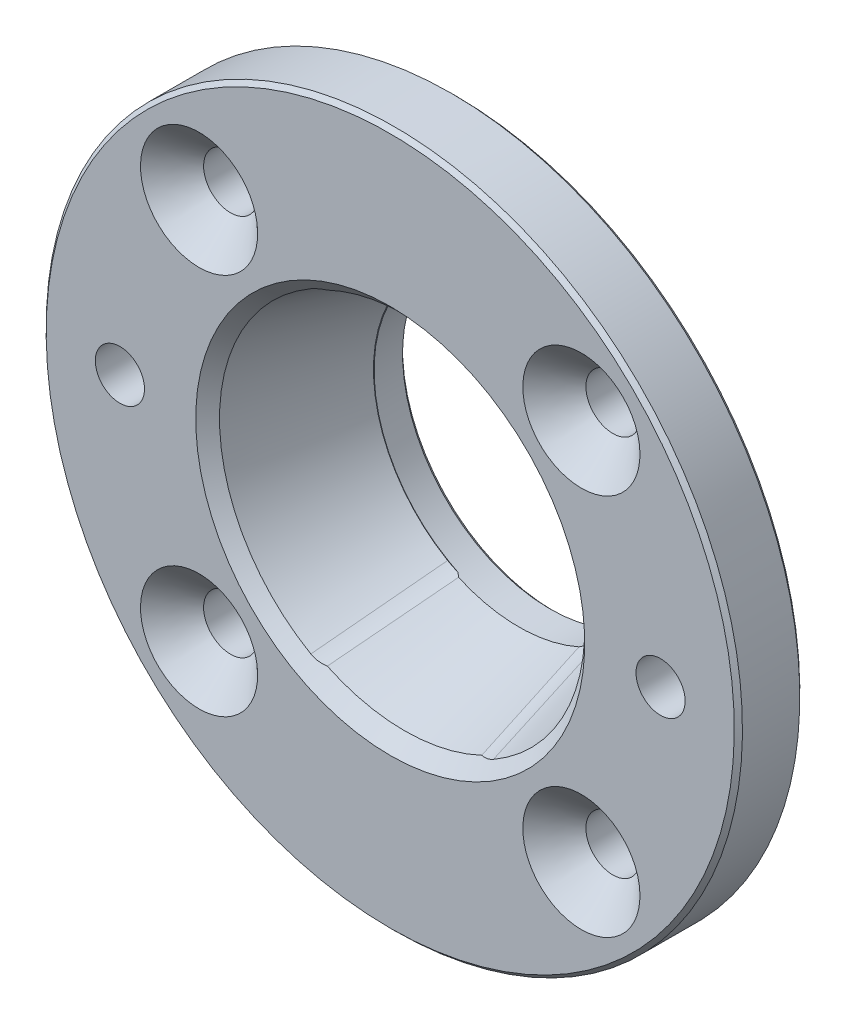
ISO-10303-21;
HEADER;
FILE_DESCRIPTION(('STEP AP214'),'2;1');
FILE_NAME('part.step','',(''),(''),'','','');
FILE_SCHEMA(('AUTOMOTIVE_DESIGN { 1 0 10303 214 1 1 1 1 }'));
ENDSEC;
DATA;
#1=APPLICATION_CONTEXT('core data for automotive mechanical design processes');
#2=APPLICATION_PROTOCOL_DEFINITION('international standard','automotive_design',2000,#1);
#3=PRODUCT_CONTEXT('',#1,'mechanical');
#4=PRODUCT('Part','Part','',(#3));
#5=PRODUCT_RELATED_PRODUCT_CATEGORY('part','',(#4));
#6=PRODUCT_DEFINITION_FORMATION('','',#4);
#7=PRODUCT_DEFINITION_CONTEXT('part definition',#1,'design');
#8=PRODUCT_DEFINITION('design','',#6,#7);
#9=PRODUCT_DEFINITION_SHAPE('','',#8);
#10=(LENGTH_UNIT() NAMED_UNIT(*) SI_UNIT(.MILLI.,.METRE.));
#11=(NAMED_UNIT(*) PLANE_ANGLE_UNIT() SI_UNIT($,.RADIAN.));
#12=(NAMED_UNIT(*) SI_UNIT($,.STERADIAN.) SOLID_ANGLE_UNIT());
#13=UNCERTAINTY_MEASURE_WITH_UNIT(LENGTH_MEASURE(1.E-05),#10,'distance_accuracy_value','');
#14=(GEOMETRIC_REPRESENTATION_CONTEXT(3) GLOBAL_UNCERTAINTY_ASSIGNED_CONTEXT((#13)) GLOBAL_UNIT_ASSIGNED_CONTEXT((#10,
#11,#12)) REPRESENTATION_CONTEXT('',''));
#15=CARTESIAN_POINT('',(0.,0.,0.));
#16=DIRECTION('',(0.,0.,1.));
#17=DIRECTION('',(1.,0.,0.));
#18=AXIS2_PLACEMENT_3D('',#15,#16,#17);
#19=CARTESIAN_POINT('',(0.,0.,-15.693364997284));
#20=DIRECTION('',(0.,0.,1.));
#21=DIRECTION('',(0.,-1.,0.));
#22=AXIS2_PLACEMENT_3D('',#19,#20,#21);
#23=CONICAL_SURFACE('',#22,18.,0.279252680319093);
#24=CARTESIAN_POINT('',(0.,0.,-1.74370722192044));
#25=DIRECTION('',(0.,0.,-1.));
#26=DIRECTION('',(0.,1.,0.));
#27=AXIS2_PLACEMENT_3D('',#24,#25,#26);
#28=CIRCLE('',#27,22.);
#29=CARTESIAN_POINT('',(-9.42545497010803,19.8786518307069,-1.74370722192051));
#30=VERTEX_POINT('',#29);
#31=CARTESIAN_POINT('',(9.42545497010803,19.8786518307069,-1.74370722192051));
#32=VERTEX_POINT('',#31);
#33=EDGE_CURVE('E107',#30,#32,#28,.T.);
#34=ORIENTED_EDGE('',*,*,#33,.F.);
#35=CARTESIAN_POINT('',(-7.35302421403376,16.4295760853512,-15.6935649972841));
#36=CARTESIAN_POINT('',(-7.64139008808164,16.90410505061,-13.7721903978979));
#37=CARTESIAN_POINT('',(-7.92830075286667,17.3789305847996,-11.8506715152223));
#38=CARTESIAN_POINT('',(-8.49987107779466,18.3290503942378,-8.00741608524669));
#39=CARTESIAN_POINT('',(-8.78453073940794,18.8043446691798,-6.08567953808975));
#40=CARTESIAN_POINT('',(-9.1709020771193,19.4515091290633,-3.46987543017));
#41=CARTESIAN_POINT('',(-9.2733056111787,19.6232293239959,-2.77587277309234));
#42=CARTESIAN_POINT('',(-9.47792179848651,19.9667113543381,-1.38784944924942));
#43=CARTESIAN_POINT('',(-9.58013445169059,20.1384731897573,-0.693828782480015));
#44=CARTESIAN_POINT('',(-9.6822599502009,20.3102541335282,0.000199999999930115));
#45=B_SPLINE_CURVE_WITH_KNOTS('',3,(#35,#36,#37,#38,#39,#40,#41,#42,#43,#44),.UNSPECIFIED.,.F.,
.F.,(4,2,2,2,4),(0.,6.00000800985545,12.0000121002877,14.1666975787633,16.3333835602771),.UNSPECIFIED.);
#46=CARTESIAN_POINT('',(-7.35305423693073,16.4296254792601,-15.6933649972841));
#47=VERTEX_POINT('',#46);
#48=EDGE_CURVE('E248',#47,#30,#45,.T.);
#49=ORIENTED_EDGE('',*,*,#48,.F.);
#50=CARTESIAN_POINT('',(0.,0.,-15.693364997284));
#51=DIRECTION('',(0.,0.,1.));
#52=DIRECTION('',(0.,-1.,0.));
#53=AXIS2_PLACEMENT_3D('',#50,#51,#52);
#54=CIRCLE('',#53,18.);
#55=CARTESIAN_POINT('',(7.35305423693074,16.4296254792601,-15.6933649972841));
#56=VERTEX_POINT('',#55);
#57=EDGE_CURVE('E127',#56,#47,#54,.T.);
#58=ORIENTED_EDGE('',*,*,#57,.F.);
#59=CARTESIAN_POINT('',(9.68225995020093,20.3102541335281,0.000199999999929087));
#60=CARTESIAN_POINT('',(9.42060674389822,19.8701956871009,-1.77774052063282));
#61=CARTESIAN_POINT('',(9.15844250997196,19.4302521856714,-3.55563479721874));
#62=CARTESIAN_POINT('',(8.63262309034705,18.5506848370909,-7.11128040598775));
#63=CARTESIAN_POINT('',(8.36896790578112,18.1110609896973,-8.8890317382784));
#64=CARTESIAN_POINT('',(7.97960231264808,17.4645303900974,-11.5045484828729));
#65=CARTESIAN_POINT('',(7.85465429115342,17.2574646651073,-12.3423880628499));
#66=CARTESIAN_POINT('',(7.60424430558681,16.8434381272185,-14.0180166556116));
#67=CARTESIAN_POINT('',(7.47878234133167,16.6364773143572,-14.8558056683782));
#68=CARTESIAN_POINT('',(7.35302421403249,16.429576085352,-15.6935649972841));
#69=B_SPLINE_CURVE_WITH_KNOTS('',3,(#59,#60,#61,#62,#63,#64,#65,#66,#67,#68),.UNSPECIFIED.,.F.,
.F.,(4,2,2,2,4),(0.,5.55055717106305,11.1011101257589,13.717246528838,16.3333838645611),.UNSPECIFIED.);
#70=EDGE_CURVE('E120',#32,#56,#69,.T.);
#71=ORIENTED_EDGE('',*,*,#70,.F.);
#72=EDGE_LOOP('',(#34,#49,#58,#71));
#73=FACE_BOUND('',#72,.T.);
#74=ADVANCED_FACE('F16',(#73),#23,.F.);
#75=CARTESIAN_POINT('',(0.,0.,0.));
#76=DIRECTION('',(0.,0.,1.));
#77=DIRECTION('',(0.,-1.,0.));
#78=AXIS2_PLACEMENT_3D('',#75,#76,#77);
#79=CYLINDRICAL_SURFACE('',#78,18.);
#80=CARTESIAN_POINT('',(0.,0.,-10.8687068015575));
#81=DIRECTION('',(0.1378186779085,0.238708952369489,-0.96126169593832));
#82=DIRECTION('',(0.480630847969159,0.832477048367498,0.275637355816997));
#83=AXIS2_PLACEMENT_3D('',#80,#81,#82);
#84=ELLIPSE('',#83,18.7253898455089,18.);
#85=CARTESIAN_POINT('',(-7.77013182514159,-16.2365344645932,-16.0147304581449));
#86=VERTEX_POINT('',#85);
#87=CARTESIAN_POINT('',(-9.,-15.5884572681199,-16.030123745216));
#88=VERTEX_POINT('',#87);
#89=EDGE_CURVE('E326',#86,#88,#84,.T.);
#90=ORIENTED_EDGE('',*,*,#89,.F.);
#91=CARTESIAN_POINT('',(-7.35305423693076,-16.4296254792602,-15.693364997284));
#92=CARTESIAN_POINT('',(-7.38625739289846,-16.4147653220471,-15.7228188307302));
#93=CARTESIAN_POINT('',(-7.41985621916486,-16.399607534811,-15.7516816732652));
#94=CARTESIAN_POINT('',(-7.48779826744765,-16.3686978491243,-15.8080782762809));
#95=CARTESIAN_POINT('',(-7.52214041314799,-16.352946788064,-15.8356137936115));
#96=CARTESIAN_POINT('',(-7.5916139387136,-16.3208107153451,-15.8892904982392));
#97=CARTESIAN_POINT('',(-7.62674534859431,-16.3044256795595,-15.9154316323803));
#98=CARTESIAN_POINT('',(-7.69783319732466,-16.2709836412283,-15.966233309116));
#99=CARTESIAN_POINT('',(-7.73379069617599,-16.2539257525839,-15.9908917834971));
#100=CARTESIAN_POINT('',(-7.77013182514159,-16.2365344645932,-16.0147304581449));
#101=B_SPLINE_CURVE_WITH_KNOTS('',3,(#91,#92,#93,#94,#95,#96,#97,#98,#99,#100),.UNSPECIFIED.,
.F.,.F.,(4,2,2,2,4),(0.,0.140416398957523,0.280641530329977,0.420872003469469,
0.561293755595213),.UNSPECIFIED.);
#102=CARTESIAN_POINT('',(-7.35305423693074,-16.4296254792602,-15.693364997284));
#103=VERTEX_POINT('',#102);
#104=EDGE_CURVE('E396',#103,#86,#101,.T.);
#105=ORIENTED_EDGE('',*,*,#104,.F.);
#106=CARTESIAN_POINT('',(7.35305423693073,-16.4296254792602,-15.693364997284));
#107=VERTEX_POINT('',#106);
#108=EDGE_CURVE('E331',#103,#107,#54,.T.);
#109=ORIENTED_EDGE('',*,*,#108,.T.);
#110=CARTESIAN_POINT('',(7.77013182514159,-16.2365344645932,-16.0147304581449));
#111=CARTESIAN_POINT('',(7.733790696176,-16.2539257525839,-15.9908917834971));
#112=CARTESIAN_POINT('',(7.69783319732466,-16.2709836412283,-15.966233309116));
#113=CARTESIAN_POINT('',(7.62674534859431,-16.3044256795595,-15.9154316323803));
#114=CARTESIAN_POINT('',(7.59161393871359,-16.3208107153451,-15.8892904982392));
#115=CARTESIAN_POINT('',(7.52214041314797,-16.3529467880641,-15.8356137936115));
#116=CARTESIAN_POINT('',(7.48779826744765,-16.3686978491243,-15.8080782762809));
#117=CARTESIAN_POINT('',(7.41985621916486,-16.399607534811,-15.7516816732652));
#118=CARTESIAN_POINT('',(7.38625739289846,-16.4147653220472,-15.7228188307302));
#119=CARTESIAN_POINT('',(7.35305423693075,-16.4296254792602,-15.693364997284));
#120=B_SPLINE_CURVE_WITH_KNOTS('',3,(#110,#111,#112,#113,#114,#115,#116,#117,#118,#119),
.UNSPECIFIED.,.F.,.F.,(4,2,2,2,4),(0.,0.140421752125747,0.280652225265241,0.420877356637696,
0.56129375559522),.UNSPECIFIED.);
#121=CARTESIAN_POINT('',(7.77013182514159,-16.2365344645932,-16.0147304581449));
#122=VERTEX_POINT('',#121);
#123=EDGE_CURVE('E221',#122,#107,#120,.T.);
#124=ORIENTED_EDGE('',*,*,#123,.F.);
#125=CARTESIAN_POINT('',(0.,0.,-10.8687068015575));
#126=DIRECTION('',(-0.1378186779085,0.238708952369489,-0.96126169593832));
#127=DIRECTION('',(-0.480630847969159,0.832477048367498,0.275637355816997));
#128=AXIS2_PLACEMENT_3D('',#125,#126,#127);
#129=ELLIPSE('',#128,18.7253898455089,18.);
#130=CARTESIAN_POINT('',(9.,-15.5884572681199,-16.030123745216));
#131=VERTEX_POINT('',#130);
#132=EDGE_CURVE('E133',#131,#122,#129,.T.);
#133=ORIENTED_EDGE('',*,*,#132,.F.);
#134=CARTESIAN_POINT('',(0.,0.,-16.030123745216));
#135=DIRECTION('',(0.,0.,-1.));
#136=DIRECTION('',(0.,1.,0.));
#137=AXIS2_PLACEMENT_3D('',#134,#135,#136);
#138=CIRCLE('',#137,18.);
#139=CARTESIAN_POINT('',(9.,15.5884572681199,-16.0301237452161));
#140=VERTEX_POINT('',#139);
#141=EDGE_CURVE('E361',#131,#140,#138,.F.);
#142=ORIENTED_EDGE('',*,*,#141,.T.);
#143=CARTESIAN_POINT('',(0.,0.,-10.8687068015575));
#144=DIRECTION('',(-0.1378186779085,-0.238708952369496,-0.961261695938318));
#145=DIRECTION('',(-0.480630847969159,-0.832477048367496,0.275637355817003));
#146=AXIS2_PLACEMENT_3D('',#143,#144,#145);
#147=ELLIPSE('',#146,18.7253898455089,18.);
#148=CARTESIAN_POINT('',(7.77013182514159,16.2365344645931,-16.014730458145));
#149=VERTEX_POINT('',#148);
#150=EDGE_CURVE('E131',#149,#140,#147,.T.);
#151=ORIENTED_EDGE('',*,*,#150,.F.);
#152=CARTESIAN_POINT('',(7.35305423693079,16.4296254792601,-15.6933649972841));
#153=CARTESIAN_POINT('',(7.38625739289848,16.414765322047,-15.7228188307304));
#154=CARTESIAN_POINT('',(7.41985621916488,16.3996075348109,-15.7516816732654));
#155=CARTESIAN_POINT('',(7.48779826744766,16.3686978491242,-15.808078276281));
#156=CARTESIAN_POINT('',(7.52214041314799,16.3529467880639,-15.8356137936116));
#157=CARTESIAN_POINT('',(7.5916139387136,16.320810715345,-15.8892904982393));
#158=CARTESIAN_POINT('',(7.62674534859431,16.3044256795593,-15.9154316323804));
#159=CARTESIAN_POINT('',(7.69783319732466,16.2709836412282,-15.9662333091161));
#160=CARTESIAN_POINT('',(7.73379069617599,16.2539257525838,-15.9908917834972));
#161=CARTESIAN_POINT('',(7.77013182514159,16.2365344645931,-16.014730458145));
#162=B_SPLINE_CURVE_WITH_KNOTS('',3,(#152,#153,#154,#155,#156,#157,#158,#159,#160,#161),
.UNSPECIFIED.,.F.,.F.,(4,2,2,2,4),(0.,0.140416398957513,0.28064153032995,0.420872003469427,
0.561293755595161),.UNSPECIFIED.);
#163=EDGE_CURVE('E128',#56,#149,#162,.T.);
#164=ORIENTED_EDGE('',*,*,#163,.F.);
#165=ORIENTED_EDGE('',*,*,#57,.T.);
#166=CARTESIAN_POINT('',(-7.77013182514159,16.2365344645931,-16.014730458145));
#167=CARTESIAN_POINT('',(-7.73379069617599,16.2539257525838,-15.9908917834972));
#168=CARTESIAN_POINT('',(-7.69783319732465,16.2709836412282,-15.9662333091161));
#169=CARTESIAN_POINT('',(-7.6267453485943,16.3044256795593,-15.9154316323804));
#170=CARTESIAN_POINT('',(-7.59161393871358,16.320810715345,-15.8892904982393));
#171=CARTESIAN_POINT('',(-7.52214041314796,16.3529467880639,-15.8356137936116));
#172=CARTESIAN_POINT('',(-7.48779826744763,16.3686978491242,-15.808078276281));
#173=CARTESIAN_POINT('',(-7.41985621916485,16.3996075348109,-15.7516816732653));
#174=CARTESIAN_POINT('',(-7.38625739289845,16.414765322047,-15.7228188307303));
#175=CARTESIAN_POINT('',(-7.35305423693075,16.4296254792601,-15.6933649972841));
#176=B_SPLINE_CURVE_WITH_KNOTS('',3,(#166,#167,#168,#169,#170,#171,#172,#173,#174,#175),
.UNSPECIFIED.,.F.,.F.,(4,2,2,2,4),(0.,0.14042175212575,0.280652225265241,0.420877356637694,
0.561293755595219),.UNSPECIFIED.);
#177=CARTESIAN_POINT('',(-7.77013182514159,16.2365344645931,-16.014730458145));
#178=VERTEX_POINT('',#177);
#179=EDGE_CURVE('E240',#178,#47,#176,.T.);
#180=ORIENTED_EDGE('',*,*,#179,.F.);
#181=CARTESIAN_POINT('',(0.,0.,-10.8687068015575));
#182=DIRECTION('',(0.1378186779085,-0.238708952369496,-0.961261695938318));
#183=DIRECTION('',(0.480630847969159,-0.832477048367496,0.275637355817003));
#184=AXIS2_PLACEMENT_3D('',#181,#182,#183);
#185=ELLIPSE('',#184,18.7253898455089,18.);
#186=CARTESIAN_POINT('',(-9.,15.5884572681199,-16.0301237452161));
#187=VERTEX_POINT('',#186);
#188=EDGE_CURVE('E247',#187,#178,#185,.T.);
#189=ORIENTED_EDGE('',*,*,#188,.F.);
#190=CARTESIAN_POINT('',(0.,0.,-16.030123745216));
#191=DIRECTION('',(0.,0.,-1.));
#192=DIRECTION('',(0.,1.,0.));
#193=AXIS2_PLACEMENT_3D('',#190,#191,#192);
#194=CIRCLE('',#193,18.);
#195=EDGE_CURVE('E363',#187,#88,#194,.F.);
#196=ORIENTED_EDGE('',*,*,#195,.T.);
#197=EDGE_LOOP('',(#90,#105,#109,#124,#133,#142,#151,#164,#165,#180,#189,#196));
#198=FACE_BOUND('',#197,.T.);
#199=CARTESIAN_POINT('',(0.,0.,-19.5));
#200=DIRECTION('',(0.,0.,-1.));
#201=DIRECTION('',(0.,1.,0.));
#202=AXIS2_PLACEMENT_3D('',#199,#200,#201);
#203=CIRCLE('',#202,18.);
#204=CARTESIAN_POINT('',(0.,17.9999999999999,-19.5000000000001));
#205=VERTEX_POINT('',#204);
#206=EDGE_CURVE('E352',#205,#205,#203,.T.);
#207=ORIENTED_EDGE('',*,*,#206,.T.);
#208=EDGE_LOOP('',(#207));
#209=FACE_BOUND('',#208,.T.);
#210=ADVANCED_FACE('F227',(#198,#209),#79,.F.);
#211=CARTESIAN_POINT('',(22.5,0.,0.));
#212=DIRECTION('',(0.,0.,1.));
#213=DIRECTION('',(0.,-1.,0.));
#214=AXIS2_PLACEMENT_3D('',#211,#212,#213);
#215=PLANE('',#214);
#216=CARTESIAN_POINT('',(-33.,0.,0.));
#217=DIRECTION('',(0.,0.,1.));
#218=DIRECTION('',(1.,0.,0.));
#219=AXIS2_PLACEMENT_3D('',#216,#217,#218);
#220=CIRCLE('',#219,3.);
#221=CARTESIAN_POINT('',(-30.,0.,0.));
#222=VERTEX_POINT('',#221);
#223=EDGE_CURVE('E378',#222,#222,#220,.T.);
#224=ORIENTED_EDGE('',*,*,#223,.F.);
#225=EDGE_LOOP('',(#224));
#226=FACE_BOUND('',#225,.T.);
#227=CARTESIAN_POINT('',(33.,0.,0.));
#228=DIRECTION('',(0.,0.,1.));
#229=DIRECTION('',(1.,0.,0.));
#230=AXIS2_PLACEMENT_3D('',#227,#228,#229);
#231=CIRCLE('',#230,3.);
#232=CARTESIAN_POINT('',(36.,0.,0.));
#233=VERTEX_POINT('',#232);
#234=EDGE_CURVE('E383',#233,#233,#231,.T.);
#235=ORIENTED_EDGE('',*,*,#234,.F.);
#236=EDGE_LOOP('',(#235));
#237=FACE_BOUND('',#236,.T.);
#238=CARTESIAN_POINT('',(0.,0.,0.));
#239=DIRECTION('',(0.,0.,-1.));
#240=DIRECTION('',(0.,1.,0.));
#241=AXIS2_PLACEMENT_3D('',#238,#239,#240);
#242=CIRCLE('',#241,23.7437072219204);
#243=CARTESIAN_POINT('',(0.,23.7437072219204,0.));
#244=VERTEX_POINT('',#243);
#245=EDGE_CURVE('E296',#244,#244,#242,.T.);
#246=ORIENTED_EDGE('',*,*,#245,.T.);
#247=EDGE_LOOP('',(#246));
#248=FACE_BOUND('',#247,.T.);
#249=CARTESIAN_POINT('',(0.,0.,0.));
#250=DIRECTION('',(0.,0.,1.));
#251=DIRECTION('',(0.,-1.,0.));
#252=AXIS2_PLACEMENT_3D('',#249,#250,#251);
#253=CIRCLE('',#252,42.);
#254=CARTESIAN_POINT('',(0.,-42.,1.46642216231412E-13));
#255=VERTEX_POINT('',#254);
#256=EDGE_CURVE('E355',#255,#255,#253,.T.);
#257=ORIENTED_EDGE('',*,*,#256,.T.);
#258=EDGE_LOOP('',(#257));
#259=FACE_BOUND('',#258,.T.);
#260=CARTESIAN_POINT('',(23.334523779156,23.3345237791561,0.));
#261=DIRECTION('',(0.,0.,1.));
#262=DIRECTION('',(0.,-1.,0.));
#263=AXIS2_PLACEMENT_3D('',#260,#261,#262);
#264=CIRCLE('',#263,7.15);
#265=CARTESIAN_POINT('',(23.334523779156,16.1845237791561,0.));
#266=VERTEX_POINT('',#265);
#267=EDGE_CURVE('E420',#266,#266,#264,.T.);
#268=ORIENTED_EDGE('',*,*,#267,.F.);
#269=EDGE_LOOP('',(#268));
#270=FACE_BOUND('',#269,.T.);
#271=CARTESIAN_POINT('',(23.3345237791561,-23.334523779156,0.));
#272=DIRECTION('',(0.,0.,1.));
#273=DIRECTION('',(0.,-1.,0.));
#274=AXIS2_PLACEMENT_3D('',#271,#272,#273);
#275=CIRCLE('',#274,7.15);
#276=CARTESIAN_POINT('',(23.3345237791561,-30.484523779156,1.06436145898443E-13));
#277=VERTEX_POINT('',#276);
#278=EDGE_CURVE('E430',#277,#277,#275,.T.);
#279=ORIENTED_EDGE('',*,*,#278,.F.);
#280=EDGE_LOOP('',(#279));
#281=FACE_BOUND('',#280,.T.);
#282=CARTESIAN_POINT('',(-23.334523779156,-23.3345237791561,0.));
#283=DIRECTION('',(0.,0.,1.));
#284=DIRECTION('',(0.,-1.,0.));
#285=AXIS2_PLACEMENT_3D('',#282,#283,#284);
#286=CIRCLE('',#285,7.15);
#287=CARTESIAN_POINT('',(-23.334523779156,-30.4845237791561,1.06436145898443E-13));
#288=VERTEX_POINT('',#287);
#289=EDGE_CURVE('E436',#288,#288,#286,.T.);
#290=ORIENTED_EDGE('',*,*,#289,.F.);
#291=EDGE_LOOP('',(#290));
#292=FACE_BOUND('',#291,.T.);
#293=CARTESIAN_POINT('',(-23.3345237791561,23.334523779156,0.));
#294=DIRECTION('',(0.,0.,1.));
#295=DIRECTION('',(0.,-1.,0.));
#296=AXIS2_PLACEMENT_3D('',#293,#294,#295);
#297=CIRCLE('',#296,7.15);
#298=CARTESIAN_POINT('',(-23.3345237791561,16.184523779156,0.));
#299=VERTEX_POINT('',#298);
#300=EDGE_CURVE('E442',#299,#299,#297,.T.);
#301=ORIENTED_EDGE('',*,*,#300,.F.);
#302=EDGE_LOOP('',(#301));
#303=FACE_BOUND('',#302,.T.);
#304=ADVANCED_FACE('F231',(#226,#237,#248,#259,#270,#281,#292,#303),#215,.T.);
#305=CARTESIAN_POINT('',(9.42545497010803,-19.8786518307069,-1.74370722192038));
#306=VERTEX_POINT('',#305);
#307=CARTESIAN_POINT('',(-9.42545497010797,-19.8786518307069,-1.74370722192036));
#308=VERTEX_POINT('',#307);
#309=EDGE_CURVE('E33',#306,#308,#28,.T.);
#310=ORIENTED_EDGE('',*,*,#309,.F.);
#311=CARTESIAN_POINT('',(7.35302421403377,-16.4295760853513,-15.693564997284));
#312=CARTESIAN_POINT('',(7.64139008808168,-16.9041050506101,-13.7721903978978));
#313=CARTESIAN_POINT('',(7.92830075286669,-17.3789305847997,-11.8506715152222));
#314=CARTESIAN_POINT('',(8.49987107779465,-18.3290503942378,-8.00741608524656));
#315=CARTESIAN_POINT('',(8.78453073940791,-18.8043446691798,-6.0856795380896));
#316=CARTESIAN_POINT('',(9.1709020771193,-19.4515091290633,-3.46987543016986));
#317=CARTESIAN_POINT('',(9.27330561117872,-19.6232293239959,-2.7758727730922));
#318=CARTESIAN_POINT('',(9.47792179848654,-19.9667113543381,-1.38784944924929));
#319=CARTESIAN_POINT('',(9.58013445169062,-20.1384731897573,-0.693828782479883));
#320=CARTESIAN_POINT('',(9.6822599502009,-20.3102541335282,0.000200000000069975));
#321=B_SPLINE_CURVE_WITH_KNOTS('',3,(#311,#312,#313,#314,#315,#316,#317,#318,#319,#320),
.UNSPECIFIED.,.F.,.F.,(4,2,2,2,4),(0.,6.00000800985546,12.0000121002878,14.1666975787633,
16.3333835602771),.UNSPECIFIED.);
#322=EDGE_CURVE('E214',#107,#306,#321,.T.);
#323=ORIENTED_EDGE('',*,*,#322,.F.);
#324=ORIENTED_EDGE('',*,*,#108,.F.);
#325=CARTESIAN_POINT('',(-9.68225995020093,-20.3102541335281,0.000200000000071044));
#326=CARTESIAN_POINT('',(-9.39940984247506,-19.8345642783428,-1.9217054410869));
#327=CARTESIAN_POINT('',(-9.11597624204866,-19.3590064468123,-3.84355845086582));
#328=CARTESIAN_POINT('',(-8.54732365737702,-18.4082725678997,-7.687092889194));
#329=CARTESIAN_POINT('',(-8.26210467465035,-17.9330965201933,-9.6087743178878));
#330=CARTESIAN_POINT('',(-7.87225265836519,-17.2866667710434,-12.2242433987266));
#331=CARTESIAN_POINT('',(-7.76866499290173,-17.1151962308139,-12.9181332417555));
#332=CARTESIAN_POINT('',(-7.56112793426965,-16.7723287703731,-14.3058772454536));
#333=CARTESIAN_POINT('',(-7.45717854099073,-16.6009318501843,-14.999731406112));
#334=CARTESIAN_POINT('',(-7.35302421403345,-16.4295760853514,-15.693564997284));
#335=B_SPLINE_CURVE_WITH_KNOTS('',3,(#325,#326,#327,#328,#329,#330,#331,#332,#333,#334),
.UNSPECIFIED.,.F.,.F.,(4,2,2,2,4),(0.,6.00000526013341,12.0000054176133,14.1666942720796,
16.3333837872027),.UNSPECIFIED.);
#336=EDGE_CURVE('E295',#308,#103,#335,.T.);
#337=ORIENTED_EDGE('',*,*,#336,.F.);
#338=EDGE_LOOP('',(#310,#323,#324,#337));
#339=FACE_BOUND('',#338,.T.);
#340=ADVANCED_FACE('F148',(#339),#23,.F.);
#341=CARTESIAN_POINT('',(18.,0.,-20.));
#342=DIRECTION('',(0.,0.,-1.));
#343=DIRECTION('',(0.,1.,0.));
#344=AXIS2_PLACEMENT_3D('',#341,#342,#343);
#345=PLANE('',#344);
#346=CARTESIAN_POINT('',(0.,0.,-20.));
#347=DIRECTION('',(0.,0.,-1.));
#348=DIRECTION('',(0.,1.,0.));
#349=AXIS2_PLACEMENT_3D('',#346,#347,#348);
#350=CIRCLE('',#349,18.5);
#351=CARTESIAN_POINT('',(0.,18.4999999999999,-20.0000000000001));
#352=VERTEX_POINT('',#351);
#353=EDGE_CURVE('E349',#352,#352,#350,.F.);
#354=ORIENTED_EDGE('',*,*,#353,.T.);
#355=EDGE_LOOP('',(#354));
#356=FACE_BOUND('',#355,.T.);
#357=CARTESIAN_POINT('',(0.,0.,-20.));
#358=DIRECTION('',(0.,0.,-1.));
#359=DIRECTION('',(0.,1.,0.));
#360=AXIS2_PLACEMENT_3D('',#357,#358,#359);
#361=CIRCLE('',#360,24.4);
#362=CARTESIAN_POINT('',(0.,24.3999999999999,-20.0000000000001));
#363=VERTEX_POINT('',#362);
#364=EDGE_CURVE('E345',#363,#363,#361,.T.);
#365=ORIENTED_EDGE('',*,*,#364,.T.);
#366=EDGE_LOOP('',(#365));
#367=FACE_BOUND('',#366,.T.);
#368=ADVANCED_FACE('F233',(#356,#367),#345,.T.);
#369=CARTESIAN_POINT('',(0.,0.,0.));
#370=DIRECTION('',(0.,0.,1.));
#371=DIRECTION('',(0.,-1.,0.));
#372=AXIS2_PLACEMENT_3D('',#369,#370,#371);
#373=CYLINDRICAL_SURFACE('',#372,25.);
#374=CARTESIAN_POINT('',(0.,0.,-10.));
#375=DIRECTION('',(0.,0.,1.));
#376=DIRECTION('',(0.,-1.,0.));
#377=AXIS2_PLACEMENT_3D('',#374,#375,#376);
#378=CIRCLE('',#377,25.);
#379=CARTESIAN_POINT('',(0.,-25.,-9.99999999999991));
#380=VERTEX_POINT('',#379);
#381=EDGE_CURVE('E448',#380,#380,#378,.T.);
#382=ORIENTED_EDGE('',*,*,#381,.F.);
#383=EDGE_LOOP('',(#382));
#384=FACE_BOUND('',#383,.T.);
#385=CARTESIAN_POINT('',(0.,0.,-15.9));
#386=DIRECTION('',(0.,0.,1.));
#387=DIRECTION('',(0.,-1.,0.));
#388=AXIS2_PLACEMENT_3D('',#385,#386,#387);
#389=CIRCLE('',#388,25.);
#390=CARTESIAN_POINT('',(0.,-25.0000000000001,-15.8999999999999));
#391=VERTEX_POINT('',#390);
#392=EDGE_CURVE('E336',#391,#391,#389,.T.);
#393=ORIENTED_EDGE('',*,*,#392,.T.);
#394=EDGE_LOOP('',(#393));
#395=FACE_BOUND('',#394,.T.);
#396=ADVANCED_FACE('F287',(#384,#395),#373,.T.);
#397=CARTESIAN_POINT('',(25.,0.,-8.));
#398=DIRECTION('',(0.,0.,-1.));
#399=DIRECTION('',(0.,1.,0.));
#400=AXIS2_PLACEMENT_3D('',#397,#398,#399);
#401=PLANE('',#400);
#402=CARTESIAN_POINT('',(-33.,0.,-8.));
#403=DIRECTION('',(0.,0.,-1.));
#404=DIRECTION('',(0.,1.,0.));
#405=AXIS2_PLACEMENT_3D('',#402,#403,#404);
#406=CIRCLE('',#405,3.);
#407=CARTESIAN_POINT('',(-33.,3.,-8.00000000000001));
#408=VERTEX_POINT('',#407);
#409=EDGE_CURVE('E20',#408,#408,#406,.T.);
#410=ORIENTED_EDGE('',*,*,#409,.F.);
#411=EDGE_LOOP('',(#410));
#412=FACE_BOUND('',#411,.T.);
#413=CARTESIAN_POINT('',(33.,0.,-8.));
#414=DIRECTION('',(0.,0.,-1.));
#415=DIRECTION('',(0.,1.,0.));
#416=AXIS2_PLACEMENT_3D('',#413,#414,#415);
#417=CIRCLE('',#416,3.);
#418=CARTESIAN_POINT('',(33.,3.,-8.00000000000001));
#419=VERTEX_POINT('',#418);
#420=EDGE_CURVE('E376',#419,#419,#417,.T.);
#421=ORIENTED_EDGE('',*,*,#420,.F.);
#422=EDGE_LOOP('',(#421));
#423=FACE_BOUND('',#422,.T.);
#424=CARTESIAN_POINT('',(-23.3345237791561,23.334523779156,-8.));
#425=DIRECTION('',(0.,0.,-1.));
#426=DIRECTION('',(0.,1.,0.));
#427=AXIS2_PLACEMENT_3D('',#424,#425,#426);
#428=CIRCLE('',#427,3.3);
#429=CARTESIAN_POINT('',(-23.3345237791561,26.634523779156,-8.00000000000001));
#430=VERTEX_POINT('',#429);
#431=EDGE_CURVE('E10',#430,#430,#428,.T.);
#432=ORIENTED_EDGE('',*,*,#431,.F.);
#433=EDGE_LOOP('',(#432));
#434=FACE_BOUND('',#433,.T.);
#435=CARTESIAN_POINT('',(23.334523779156,23.334523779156,-8.));
#436=DIRECTION('',(0.,0.,-1.));
#437=DIRECTION('',(0.,1.,0.));
#438=AXIS2_PLACEMENT_3D('',#435,#436,#437);
#439=CIRCLE('',#438,3.3);
#440=CARTESIAN_POINT('',(23.334523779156,26.634523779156,-8.00000000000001));
#441=VERTEX_POINT('',#440);
#442=EDGE_CURVE('E25',#441,#441,#439,.T.);
#443=ORIENTED_EDGE('',*,*,#442,.F.);
#444=EDGE_LOOP('',(#443));
#445=FACE_BOUND('',#444,.T.);
#446=CARTESIAN_POINT('',(23.3345237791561,-23.3345237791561,-8.));
#447=DIRECTION('',(0.,0.,-1.));
#448=DIRECTION('',(0.,1.,0.));
#449=AXIS2_PLACEMENT_3D('',#446,#447,#448);
#450=CIRCLE('',#449,3.3);
#451=CARTESIAN_POINT('',(23.3345237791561,-20.0345237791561,-8.00000000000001));
#452=VERTEX_POINT('',#451);
#453=EDGE_CURVE('E367',#452,#452,#450,.T.);
#454=ORIENTED_EDGE('',*,*,#453,.F.);
#455=EDGE_LOOP('',(#454));
#456=FACE_BOUND('',#455,.T.);
#457=CARTESIAN_POINT('',(-23.334523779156,-23.3345237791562,-8.));
#458=DIRECTION('',(0.,0.,-1.));
#459=DIRECTION('',(0.,1.,0.));
#460=AXIS2_PLACEMENT_3D('',#457,#458,#459);
#461=CIRCLE('',#460,3.3);
#462=CARTESIAN_POINT('',(-23.334523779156,-20.0345237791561,-8.00000000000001));
#463=VERTEX_POINT('',#462);
#464=EDGE_CURVE('E364',#463,#463,#461,.T.);
#465=ORIENTED_EDGE('',*,*,#464,.F.);
#466=EDGE_LOOP('',(#465));
#467=FACE_BOUND('',#466,.T.);
#468=CARTESIAN_POINT('',(0.,0.,-8.));
#469=DIRECTION('',(0.,0.,1.));
#470=DIRECTION('',(0.,-1.,0.));
#471=AXIS2_PLACEMENT_3D('',#468,#469,#470);
#472=CIRCLE('',#471,26.);
#473=CARTESIAN_POINT('',(0.,-26.,-7.99999999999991));
#474=VERTEX_POINT('',#473);
#475=EDGE_CURVE('E457',#474,#474,#472,.T.);
#476=ORIENTED_EDGE('',*,*,#475,.T.);
#477=EDGE_LOOP('',(#476));
#478=FACE_BOUND('',#477,.T.);
#479=CARTESIAN_POINT('',(0.,0.,-8.));
#480=DIRECTION('',(0.,0.,-1.));
#481=DIRECTION('',(0.,1.,0.));
#482=AXIS2_PLACEMENT_3D('',#479,#480,#481);
#483=CIRCLE('',#482,42.);
#484=CARTESIAN_POINT('',(0.,42.,-8.00000000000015));
#485=VERTEX_POINT('',#484);
#486=EDGE_CURVE('E334',#485,#485,#483,.T.);
#487=ORIENTED_EDGE('',*,*,#486,.T.);
#488=EDGE_LOOP('',(#487));
#489=FACE_BOUND('',#488,.T.);
#490=ADVANCED_FACE('F486',(#412,#423,#434,#445,#456,#467,#478,#489),#401,.T.);
#491=CARTESIAN_POINT('',(0.,0.,0.));
#492=DIRECTION('',(0.,0.,1.));
#493=DIRECTION('',(0.,-1.,0.));
#494=AXIS2_PLACEMENT_3D('',#491,#492,#493);
#495=CYLINDRICAL_SURFACE('',#494,42.5);
#496=CARTESIAN_POINT('',(0.,0.,-0.5));
#497=DIRECTION('',(0.,0.,1.));
#498=DIRECTION('',(0.,-1.,0.));
#499=AXIS2_PLACEMENT_3D('',#496,#497,#498);
#500=CIRCLE('',#499,42.5);
#501=CARTESIAN_POINT('',(0.,-42.5,-0.499999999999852));
#502=VERTEX_POINT('',#501);
#503=EDGE_CURVE('E358',#502,#502,#500,.F.);
#504=ORIENTED_EDGE('',*,*,#503,.T.);
#505=EDGE_LOOP('',(#504));
#506=FACE_BOUND('',#505,.T.);
#507=CARTESIAN_POINT('',(0.,0.,-7.5));
#508=DIRECTION('',(0.,0.,-1.));
#509=DIRECTION('',(0.,1.,0.));
#510=AXIS2_PLACEMENT_3D('',#507,#508,#509);
#511=CIRCLE('',#510,42.5);
#512=CARTESIAN_POINT('',(0.,42.5,-7.50000000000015));
#513=VERTEX_POINT('',#512);
#514=EDGE_CURVE('E330',#513,#513,#511,.F.);
#515=ORIENTED_EDGE('',*,*,#514,.T.);
#516=EDGE_LOOP('',(#515));
#517=FACE_BOUND('',#516,.T.);
#518=ADVANCED_FACE('F480',(#506,#517),#495,.T.);
#519=CARTESIAN_POINT('',(0.,0.,-7.5));
#520=DIRECTION('',(0.,0.,1.));
#521=DIRECTION('',(0.,-1.,0.));
#522=AXIS2_PLACEMENT_3D('',#519,#520,#521);
#523=CONICAL_SURFACE('',#522,42.5,0.785398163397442);
#524=ORIENTED_EDGE('',*,*,#486,.F.);
#525=EDGE_LOOP('',(#524));
#526=FACE_BOUND('',#525,.T.);
#527=ORIENTED_EDGE('',*,*,#514,.F.);
#528=EDGE_LOOP('',(#527));
#529=FACE_BOUND('',#528,.T.);
#530=ADVANCED_FACE('F470',(#526,#529),#523,.T.);
#531=CARTESIAN_POINT('',(0.,0.,-16.));
#532=DIRECTION('',(0.,0.,1.));
#533=DIRECTION('',(0.,-1.,0.));
#534=AXIS2_PLACEMENT_3D('',#531,#532,#533);
#535=CONICAL_SURFACE('',#534,24.9,0.785398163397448);
#536=ORIENTED_EDGE('',*,*,#392,.F.);
#537=EDGE_LOOP('',(#536));
#538=FACE_BOUND('',#537,.T.);
#539=CARTESIAN_POINT('',(0.,0.,-16.));
#540=DIRECTION('',(0.,0.,1.));
#541=DIRECTION('',(0.,-1.,0.));
#542=AXIS2_PLACEMENT_3D('',#539,#540,#541);
#543=CIRCLE('',#542,24.9);
#544=CARTESIAN_POINT('',(0.,-24.9000000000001,-15.9999999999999));
#545=VERTEX_POINT('',#544);
#546=EDGE_CURVE('E459',#545,#545,#543,.T.);
#547=ORIENTED_EDGE('',*,*,#546,.T.);
#548=EDGE_LOOP('',(#547));
#549=FACE_BOUND('',#548,.T.);
#550=ADVANCED_FACE('F467',(#538,#549),#535,.T.);
#551=CARTESIAN_POINT('',(0.,0.,0.));
#552=DIRECTION('',(0.,0.,1.));
#553=DIRECTION('',(0.,-1.,0.));
#554=AXIS2_PLACEMENT_3D('',#551,#552,#553);
#555=CYLINDRICAL_SURFACE('',#554,24.9);
#556=CARTESIAN_POINT('',(0.,0.,-19.5));
#557=DIRECTION('',(0.,0.,-1.));
#558=DIRECTION('',(0.,1.,0.));
#559=AXIS2_PLACEMENT_3D('',#556,#557,#558);
#560=CIRCLE('',#559,24.9);
#561=CARTESIAN_POINT('',(0.,24.8999999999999,-19.5000000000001));
#562=VERTEX_POINT('',#561);
#563=EDGE_CURVE('E342',#562,#562,#560,.F.);
#564=ORIENTED_EDGE('',*,*,#563,.T.);
#565=EDGE_LOOP('',(#564));
#566=FACE_BOUND('',#565,.T.);
#567=ORIENTED_EDGE('',*,*,#546,.F.);
#568=EDGE_LOOP('',(#567));
#569=FACE_BOUND('',#568,.T.);
#570=ADVANCED_FACE('F469',(#566,#569),#555,.T.);
#571=CARTESIAN_POINT('',(0.,0.,-19.5));
#572=DIRECTION('',(0.,0.,1.));
#573=DIRECTION('',(0.,-1.,0.));
#574=AXIS2_PLACEMENT_3D('',#571,#572,#573);
#575=CONICAL_SURFACE('',#574,24.9,0.785398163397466);
#576=ORIENTED_EDGE('',*,*,#364,.F.);
#577=EDGE_LOOP('',(#576));
#578=FACE_BOUND('',#577,.T.);
#579=ORIENTED_EDGE('',*,*,#563,.F.);
#580=EDGE_LOOP('',(#579));
#581=FACE_BOUND('',#580,.T.);
#582=ADVANCED_FACE('F477',(#578,#581),#575,.T.);
#583=CARTESIAN_POINT('',(0.,0.,-7.5));
#584=DIRECTION('',(0.,0.,-1.));
#585=DIRECTION('',(0.,1.,0.));
#586=AXIS2_PLACEMENT_3D('',#583,#584,#585);
#587=CONICAL_SURFACE('',#586,25.5,0.785398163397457);
#588=ORIENTED_EDGE('',*,*,#475,.F.);
#589=EDGE_LOOP('',(#588));
#590=FACE_BOUND('',#589,.T.);
#591=CARTESIAN_POINT('',(0.,0.,-7.5));
#592=DIRECTION('',(0.,0.,1.));
#593=DIRECTION('',(0.,-1.,0.));
#594=AXIS2_PLACEMENT_3D('',#591,#592,#593);
#595=CIRCLE('',#594,25.5);
#596=CARTESIAN_POINT('',(0.,-25.5,-7.49999999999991));
#597=VERTEX_POINT('',#596);
#598=EDGE_CURVE('E454',#597,#597,#595,.T.);
#599=ORIENTED_EDGE('',*,*,#598,.T.);
#600=EDGE_LOOP('',(#599));
#601=FACE_BOUND('',#600,.T.);
#602=ADVANCED_FACE('F519',(#590,#601),#587,.F.);
#603=CARTESIAN_POINT('',(24.5,0.,-7.5));
#604=DIRECTION('',(0.,0.,1.));
#605=DIRECTION('',(0.,-1.,0.));
#606=AXIS2_PLACEMENT_3D('',#603,#604,#605);
#607=PLANE('',#606);
#608=CARTESIAN_POINT('',(0.,0.,-7.5));
#609=DIRECTION('',(0.,0.,1.));
#610=DIRECTION('',(0.,-1.,0.));
#611=AXIS2_PLACEMENT_3D('',#608,#609,#610);
#612=CIRCLE('',#611,24.5);
#613=CARTESIAN_POINT('',(0.,-24.5,-7.49999999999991));
#614=VERTEX_POINT('',#613);
#615=EDGE_CURVE('E348',#614,#614,#612,.T.);
#616=ORIENTED_EDGE('',*,*,#615,.T.);
#617=EDGE_LOOP('',(#616));
#618=FACE_BOUND('',#617,.T.);
#619=ORIENTED_EDGE('',*,*,#598,.F.);
#620=EDGE_LOOP('',(#619));
#621=FACE_BOUND('',#620,.T.);
#622=ADVANCED_FACE('F510',(#618,#621),#607,.F.);
#623=CARTESIAN_POINT('',(0.,0.,0.));
#624=DIRECTION('',(0.,0.,1.));
#625=DIRECTION('',(0.,-1.,0.));
#626=AXIS2_PLACEMENT_3D('',#623,#624,#625);
#627=CYLINDRICAL_SURFACE('',#626,24.5);
#628=ORIENTED_EDGE('',*,*,#615,.F.);
#629=EDGE_LOOP('',(#628));
#630=FACE_BOUND('',#629,.T.);
#631=CARTESIAN_POINT('',(0.,0.,-9.5));
#632=DIRECTION('',(0.,0.,1.));
#633=DIRECTION('',(0.,-1.,0.));
#634=AXIS2_PLACEMENT_3D('',#631,#632,#633);
#635=CIRCLE('',#634,24.5);
#636=CARTESIAN_POINT('',(0.,-24.5,-9.49999999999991));
#637=VERTEX_POINT('',#636);
#638=EDGE_CURVE('E451',#637,#637,#635,.T.);
#639=ORIENTED_EDGE('',*,*,#638,.T.);
#640=EDGE_LOOP('',(#639));
#641=FACE_BOUND('',#640,.T.);
#642=ADVANCED_FACE('F500',(#630,#641),#627,.T.);
#643=CARTESIAN_POINT('',(0.,0.,-10.));
#644=DIRECTION('',(0.,0.,-1.));
#645=DIRECTION('',(0.,1.,0.));
#646=AXIS2_PLACEMENT_3D('',#643,#644,#645);
#647=CONICAL_SURFACE('',#646,25.,0.785398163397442);
#648=ORIENTED_EDGE('',*,*,#638,.F.);
#649=EDGE_LOOP('',(#648));
#650=FACE_BOUND('',#649,.T.);
#651=ORIENTED_EDGE('',*,*,#381,.T.);
#652=EDGE_LOOP('',(#651));
#653=FACE_BOUND('',#652,.T.);
#654=ADVANCED_FACE('F497',(#650,#653),#647,.T.);
#655=CARTESIAN_POINT('',(0.,0.,-20.));
#656=DIRECTION('',(0.,0.,-1.));
#657=DIRECTION('',(0.,1.,0.));
#658=AXIS2_PLACEMENT_3D('',#655,#656,#657);
#659=CONICAL_SURFACE('',#658,18.5,0.785398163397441);
#660=ORIENTED_EDGE('',*,*,#206,.F.);
#661=EDGE_LOOP('',(#660));
#662=FACE_BOUND('',#661,.T.);
#663=ORIENTED_EDGE('',*,*,#353,.F.);
#664=EDGE_LOOP('',(#663));
#665=FACE_BOUND('',#664,.T.);
#666=ADVANCED_FACE('F499',(#662,#665),#659,.F.);
#667=CARTESIAN_POINT('',(-23.3345237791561,23.334523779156,0.));
#668=DIRECTION('',(0.,0.,1.));
#669=DIRECTION('',(0.,-1.,0.));
#670=AXIS2_PLACEMENT_3D('',#667,#668,#669);
#671=CYLINDRICAL_SURFACE('',#670,3.3);
#672=CARTESIAN_POINT('',(-23.3345237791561,23.334523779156,-3.85000000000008));
#673=DIRECTION('',(0.,0.,1.));
#674=DIRECTION('',(0.,-1.,0.));
#675=AXIS2_PLACEMENT_3D('',#672,#673,#674);
#676=CIRCLE('',#675,3.3);
#677=CARTESIAN_POINT('',(-23.3345237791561,20.034523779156,-3.85000000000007));
#678=VERTEX_POINT('',#677);
#679=EDGE_CURVE('E445',#678,#678,#676,.T.);
#680=ORIENTED_EDGE('',*,*,#679,.T.);
#681=EDGE_LOOP('',(#680));
#682=FACE_BOUND('',#681,.T.);
#683=ORIENTED_EDGE('',*,*,#431,.T.);
#684=EDGE_LOOP('',(#683));
#685=FACE_BOUND('',#684,.T.);
#686=ADVANCED_FACE('F18',(#682,#685),#671,.F.);
#687=CARTESIAN_POINT('',(-23.3345237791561,23.334523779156,0.));
#688=DIRECTION('',(0.,0.,1.));
#689=DIRECTION('',(0.,-1.,0.));
#690=AXIS2_PLACEMENT_3D('',#687,#688,#689);
#691=CONICAL_SURFACE('',#690,7.15,0.785398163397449);
#692=ORIENTED_EDGE('',*,*,#679,.F.);
#693=EDGE_LOOP('',(#692));
#694=FACE_BOUND('',#693,.T.);
#695=ORIENTED_EDGE('',*,*,#300,.T.);
#696=EDGE_LOOP('',(#695));
#697=FACE_BOUND('',#696,.T.);
#698=ADVANCED_FACE('F515',(#694,#697),#691,.F.);
#699=CARTESIAN_POINT('',(-23.334523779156,-23.3345237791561,0.));
#700=DIRECTION('',(0.,0.,1.));
#701=DIRECTION('',(0.,-1.,0.));
#702=AXIS2_PLACEMENT_3D('',#699,#700,#701);
#703=CYLINDRICAL_SURFACE('',#702,3.3);
#704=CARTESIAN_POINT('',(-23.334523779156,-23.3345237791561,-3.84999999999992));
#705=DIRECTION('',(0.,0.,1.));
#706=DIRECTION('',(0.,-1.,0.));
#707=AXIS2_PLACEMENT_3D('',#704,#705,#706);
#708=CIRCLE('',#707,3.3);
#709=CARTESIAN_POINT('',(-23.334523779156,-26.6345237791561,-3.84999999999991));
#710=VERTEX_POINT('',#709);
#711=EDGE_CURVE('E439',#710,#710,#708,.T.);
#712=ORIENTED_EDGE('',*,*,#711,.T.);
#713=EDGE_LOOP('',(#712));
#714=FACE_BOUND('',#713,.T.);
#715=ORIENTED_EDGE('',*,*,#464,.T.);
#716=EDGE_LOOP('',(#715));
#717=FACE_BOUND('',#716,.T.);
#718=ADVANCED_FACE('F550',(#714,#717),#703,.F.);
#719=CARTESIAN_POINT('',(-23.334523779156,-23.3345237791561,0.));
#720=DIRECTION('',(0.,0.,1.));
#721=DIRECTION('',(0.,-1.,0.));
#722=AXIS2_PLACEMENT_3D('',#719,#720,#721);
#723=CONICAL_SURFACE('',#722,7.15,0.785398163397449);
#724=ORIENTED_EDGE('',*,*,#711,.F.);
#725=EDGE_LOOP('',(#724));
#726=FACE_BOUND('',#725,.T.);
#727=ORIENTED_EDGE('',*,*,#289,.T.);
#728=EDGE_LOOP('',(#727));
#729=FACE_BOUND('',#728,.T.);
#730=ADVANCED_FACE('F553',(#726,#729),#723,.F.);
#731=CARTESIAN_POINT('',(23.3345237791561,-23.334523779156,0.));
#732=DIRECTION('',(0.,0.,1.));
#733=DIRECTION('',(0.,-1.,0.));
#734=AXIS2_PLACEMENT_3D('',#731,#732,#733);
#735=CYLINDRICAL_SURFACE('',#734,3.3);
#736=CARTESIAN_POINT('',(23.3345237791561,-23.334523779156,-3.84999999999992));
#737=DIRECTION('',(0.,0.,1.));
#738=DIRECTION('',(0.,-1.,0.));
#739=AXIS2_PLACEMENT_3D('',#736,#737,#738);
#740=CIRCLE('',#739,3.3);
#741=CARTESIAN_POINT('',(23.3345237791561,-26.634523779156,-3.84999999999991));
#742=VERTEX_POINT('',#741);
#743=EDGE_CURVE('E433',#742,#742,#740,.T.);
#744=ORIENTED_EDGE('',*,*,#743,.T.);
#745=EDGE_LOOP('',(#744));
#746=FACE_BOUND('',#745,.T.);
#747=ORIENTED_EDGE('',*,*,#453,.T.);
#748=EDGE_LOOP('',(#747));
#749=FACE_BOUND('',#748,.T.);
#750=ADVANCED_FACE('F555',(#746,#749),#735,.F.);
#751=CARTESIAN_POINT('',(23.3345237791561,-23.334523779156,0.));
#752=DIRECTION('',(0.,0.,1.));
#753=DIRECTION('',(0.,-1.,0.));
#754=AXIS2_PLACEMENT_3D('',#751,#752,#753);
#755=CONICAL_SURFACE('',#754,7.15,0.785398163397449);
#756=ORIENTED_EDGE('',*,*,#743,.F.);
#757=EDGE_LOOP('',(#756));
#758=FACE_BOUND('',#757,.T.);
#759=ORIENTED_EDGE('',*,*,#278,.T.);
#760=EDGE_LOOP('',(#759));
#761=FACE_BOUND('',#760,.T.);
#762=ADVANCED_FACE('F557',(#758,#761),#755,.F.);
#763=CARTESIAN_POINT('',(23.334523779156,23.3345237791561,0.));
#764=DIRECTION('',(0.,0.,1.));
#765=DIRECTION('',(0.,-1.,0.));
#766=AXIS2_PLACEMENT_3D('',#763,#764,#765);
#767=CYLINDRICAL_SURFACE('',#766,3.3);
#768=CARTESIAN_POINT('',(23.334523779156,23.3345237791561,-3.85000000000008));
#769=DIRECTION('',(0.,0.,1.));
#770=DIRECTION('',(0.,-1.,0.));
#771=AXIS2_PLACEMENT_3D('',#768,#769,#770);
#772=CIRCLE('',#771,3.3);
#773=CARTESIAN_POINT('',(23.334523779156,20.0345237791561,-3.85000000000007));
#774=VERTEX_POINT('',#773);
#775=EDGE_CURVE('E427',#774,#774,#772,.T.);
#776=ORIENTED_EDGE('',*,*,#775,.T.);
#777=EDGE_LOOP('',(#776));
#778=FACE_BOUND('',#777,.T.);
#779=ORIENTED_EDGE('',*,*,#442,.T.);
#780=EDGE_LOOP('',(#779));
#781=FACE_BOUND('',#780,.T.);
#782=ADVANCED_FACE('F559',(#778,#781),#767,.F.);
#783=CARTESIAN_POINT('',(23.334523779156,23.3345237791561,0.));
#784=DIRECTION('',(0.,0.,1.));
#785=DIRECTION('',(0.,-1.,0.));
#786=AXIS2_PLACEMENT_3D('',#783,#784,#785);
#787=CONICAL_SURFACE('',#786,7.15,0.785398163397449);
#788=ORIENTED_EDGE('',*,*,#775,.F.);
#789=EDGE_LOOP('',(#788));
#790=FACE_BOUND('',#789,.T.);
#791=ORIENTED_EDGE('',*,*,#267,.T.);
#792=EDGE_LOOP('',(#791));
#793=FACE_BOUND('',#792,.T.);
#794=ADVANCED_FACE('F548',(#790,#793),#787,.F.);
#795=CARTESIAN_POINT('',(0.,0.,0.));
#796=DIRECTION('',(0.,0.,-1.));
#797=DIRECTION('',(0.,1.,0.));
#798=AXIS2_PLACEMENT_3D('',#795,#796,#797);
#799=CONICAL_SURFACE('',#798,42.,0.785398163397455);
#800=ORIENTED_EDGE('',*,*,#503,.F.);
#801=EDGE_LOOP('',(#800));
#802=FACE_BOUND('',#801,.T.);
#803=ORIENTED_EDGE('',*,*,#256,.F.);
#804=EDGE_LOOP('',(#803));
#805=FACE_BOUND('',#804,.T.);
#806=ADVANCED_FACE('F545',(#802,#805),#799,.T.);
#807=CARTESIAN_POINT('',(0.,0.,-16.0596656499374));
#808=DIRECTION('',(0.,0.,-1.));
#809=DIRECTION('',(0.,1.,0.));
#810=AXIS2_PLACEMENT_3D('',#807,#808,#809);
#811=CONICAL_SURFACE('',#810,18.1030248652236,1.2915436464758);
#812=DIRECTION('',(-0.480630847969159,0.832477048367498,0.275637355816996));
#813=VECTOR('',#812,1.);
#814=CARTESIAN_POINT('',(9.05151243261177,-15.677679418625,-16.0596656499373));
#815=LINE('',#814,#813);
#816=CARTESIAN_POINT('',(9.05151243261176,-15.677679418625,-16.0596656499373));
#817=VERTEX_POINT('',#816);
#818=EDGE_CURVE('E413',#817,#131,#815,.T.);
#819=ORIENTED_EDGE('',*,*,#818,.F.);
#820=CARTESIAN_POINT('',(0.,0.,-16.0596656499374));
#821=DIRECTION('',(0.,0.,-1.));
#822=DIRECTION('',(0.,1.,0.));
#823=AXIS2_PLACEMENT_3D('',#820,#821,#822);
#824=CIRCLE('',#823,18.1030248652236);
#825=CARTESIAN_POINT('',(9.05151243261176,15.6776794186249,-16.0596656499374));
#826=VERTEX_POINT('',#825);
#827=EDGE_CURVE('E416',#826,#817,#824,.T.);
#828=ORIENTED_EDGE('',*,*,#827,.F.);
#829=DIRECTION('',(-0.480630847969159,-0.832477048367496,0.275637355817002));
#830=VECTOR('',#829,1.);
#831=CARTESIAN_POINT('',(9.05151243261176,15.6776794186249,-16.0596656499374));
#832=LINE('',#831,#830);
#833=EDGE_CURVE('E415',#826,#140,#832,.T.);
#834=ORIENTED_EDGE('',*,*,#833,.T.);
#835=ORIENTED_EDGE('',*,*,#141,.F.);
#836=EDGE_LOOP('',(#819,#828,#834,#835));
#837=FACE_BOUND('',#836,.T.);
#838=ADVANCED_FACE('F411',(#837),#811,.T.);
#839=CARTESIAN_POINT('',(0.,0.,0.));
#840=DIRECTION('',(0.,0.,1.));
#841=DIRECTION('',(0.,-1.,0.));
#842=AXIS2_PLACEMENT_3D('',#839,#840,#841);
#843=CONICAL_SURFACE('',#842,22.7080598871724,0.279252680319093);
#844=CARTESIAN_POINT('',(0.,0.,-1.45200229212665));
#845=DIRECTION('',(0.,0.,1.));
#846=DIRECTION('',(0.,-1.,0.));
#847=AXIS2_PLACEMENT_3D('',#844,#845,#846);
#848=CIRCLE('',#847,22.2917049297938);
#849=CARTESIAN_POINT('',(11.1458524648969,19.3051827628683,-1.45200229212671));
#850=VERTEX_POINT('',#849);
#851=CARTESIAN_POINT('',(11.145852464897,-19.3051827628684,-1.45200229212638));
#852=VERTEX_POINT('',#851);
#853=EDGE_CURVE('E123',#850,#852,#848,.F.);
#854=ORIENTED_EDGE('',*,*,#853,.F.);
#855=DIRECTION('',(-0.1378186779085,-0.238708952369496,-0.961261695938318));
#856=VECTOR('',#855,1.);
#857=CARTESIAN_POINT('',(11.3540299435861,19.6657567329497,0.));
#858=LINE('',#857,#856);
#859=EDGE_CURVE('E41',#850,#826,#858,.T.);
#860=ORIENTED_EDGE('',*,*,#859,.T.);
#861=ORIENTED_EDGE('',*,*,#827,.T.);
#862=DIRECTION('',(-0.1378186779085,0.238708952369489,-0.96126169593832));
#863=VECTOR('',#862,1.);
#864=CARTESIAN_POINT('',(11.3540299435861,-19.6657567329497,0.));
#865=LINE('',#864,#863);
#866=EDGE_CURVE('E846',#852,#817,#865,.T.);
#867=ORIENTED_EDGE('',*,*,#866,.F.);
#868=EDGE_LOOP('',(#854,#860,#861,#867));
#869=FACE_BOUND('',#868,.T.);
#870=ADVANCED_FACE('F690',(#869),#843,.F.);
#871=CARTESIAN_POINT('',(9.05151243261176,15.6776794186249,-16.0596656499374));
#872=DIRECTION('',(-0.1378186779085,-0.238708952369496,-0.961261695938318));
#873=DIRECTION('',(0.,0.970522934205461,-0.241008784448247));
#874=AXIS2_PLACEMENT_3D('',#871,#872,#873);
#875=PLANE('',#874);
#876=ORIENTED_EDGE('',*,*,#150,.T.);
#877=ORIENTED_EDGE('',*,*,#833,.F.);
#878=CARTESIAN_POINT('',(6.16772734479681,10.6828171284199,-14.4058415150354));
#879=DIRECTION('',(-0.1378186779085,-0.238708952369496,-0.961261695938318));
#880=DIRECTION('',(0.,0.970522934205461,-0.241008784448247));
#881=AXIS2_PLACEMENT_3D('',#878,#879,#880);
#882=CIRCLE('',#881,6.);
#883=EDGE_CURVE('E129',#149,#826,#882,.T.);
#884=ORIENTED_EDGE('',*,*,#883,.F.);
#885=EDGE_LOOP('',(#876,#877,#884));
#886=FACE_BOUND('',#885,.T.);
#887=ADVANCED_FACE('F156',(#886),#875,.F.);
#888=CARTESIAN_POINT('',(6.16772734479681,10.6828171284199,-14.4058415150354));
#889=DIRECTION('',(-0.1378186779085,-0.238708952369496,-0.961261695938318));
#890=DIRECTION('',(0.,0.970522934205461,-0.241008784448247));
#891=AXIS2_PLACEMENT_3D('',#888,#889,#890);
#892=CYLINDRICAL_SURFACE('',#891,6.);
#893=ORIENTED_EDGE('',*,*,#859,.F.);
#894=CARTESIAN_POINT('',(11.3542299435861,19.1771052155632,-1.45739074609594));
#895=CARTESIAN_POINT('',(11.2656927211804,19.2349768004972,-1.45270758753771));
#896=CARTESIAN_POINT('',(11.1749516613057,19.28970758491,-1.45108357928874));
#897=CARTESIAN_POINT('',(10.9899077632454,19.3925115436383,-1.45387837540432));
#898=CARTESIAN_POINT('',(10.8956063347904,19.4405873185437,-1.45829481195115));
#899=CARTESIAN_POINT('',(10.706425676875,19.5287221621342,-1.47292069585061));
#900=CARTESIAN_POINT('',(10.6116100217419,19.5689406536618,-1.48299408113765));
#901=CARTESIAN_POINT('',(10.4201308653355,19.642589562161,-1.50859778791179));
#902=CARTESIAN_POINT('',(10.3234677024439,19.6760212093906,-1.52412711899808));
#903=CARTESIAN_POINT('',(10.0947164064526,19.746729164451,-1.56673046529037));
#904=CARTESIAN_POINT('',(9.96215822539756,19.7812028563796,-1.59594447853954));
#905=CARTESIAN_POINT('',(9.69446679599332,19.838769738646,-1.66336660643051));
#906=CARTESIAN_POINT('',(9.55932643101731,19.8616709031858,-1.70171186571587));
#907=CARTESIAN_POINT('',(9.42481675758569,19.8787330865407,-1.7439072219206));
#908=B_SPLINE_CURVE_WITH_KNOTS('',3,(#894,#895,#896,#897,#898,#899,#900,#901,#902,#903,#904,
#905,#906,#907),.UNSPECIFIED.,.F.,.F.,(4,2,2,2,2,2,4),(0.,0.317505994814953,0.634887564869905,
0.944943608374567,1.25494339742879,1.67427730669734,2.10035791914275),.UNSPECIFIED.);
#909=EDGE_CURVE('E110',#850,#32,#908,.T.);
#910=ORIENTED_EDGE('',*,*,#909,.T.);
#911=ORIENTED_EDGE('',*,*,#70,.T.);
#912=ORIENTED_EDGE('',*,*,#163,.T.);
#913=ORIENTED_EDGE('',*,*,#883,.T.);
#914=EDGE_LOOP('',(#893,#910,#911,#912,#913));
#915=FACE_BOUND('',#914,.T.);
#916=ADVANCED_FACE('F119',(#915),#892,.F.);
#917=CARTESIAN_POINT('',(9.05151243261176,-15.677679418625,-16.0596656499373));
#918=DIRECTION('',(-0.1378186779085,0.238708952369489,-0.96126169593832));
#919=DIRECTION('',(0.,-0.970522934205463,-0.241008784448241));
#920=AXIS2_PLACEMENT_3D('',#917,#918,#919);
#921=PLANE('',#920);
#922=ORIENTED_EDGE('',*,*,#132,.T.);
#923=CARTESIAN_POINT('',(6.16772734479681,-10.68281712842,-14.4058415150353));
#924=DIRECTION('',(0.1378186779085,-0.238708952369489,0.96126169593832));
#925=DIRECTION('',(0.,-0.970522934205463,-0.241008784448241));
#926=AXIS2_PLACEMENT_3D('',#923,#924,#925);
#927=CIRCLE('',#926,6.);
#928=EDGE_CURVE('E300',#122,#817,#927,.T.);
#929=ORIENTED_EDGE('',*,*,#928,.T.);
#930=ORIENTED_EDGE('',*,*,#818,.T.);
#931=EDGE_LOOP('',(#922,#929,#930));
#932=FACE_BOUND('',#931,.T.);
#933=ADVANCED_FACE('F155',(#932),#921,.F.);
#934=CARTESIAN_POINT('',(6.16772734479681,-10.68281712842,-14.4058415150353));
#935=DIRECTION('',(-0.1378186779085,0.238708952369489,-0.96126169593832));
#936=DIRECTION('',(0.,-0.970522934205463,-0.241008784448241));
#937=AXIS2_PLACEMENT_3D('',#934,#935,#936);
#938=CYLINDRICAL_SURFACE('',#937,6.);
#939=ORIENTED_EDGE('',*,*,#322,.T.);
#940=CARTESIAN_POINT('',(9.4248167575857,-19.8787330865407,-1.74390722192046));
#941=CARTESIAN_POINT('',(9.52518218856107,-19.8659738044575,-1.71244205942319));
#942=CARTESIAN_POINT('',(9.62585139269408,-19.8500041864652,-1.68311171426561));
#943=CARTESIAN_POINT('',(9.82727264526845,-19.8113365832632,-1.62912885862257));
#944=CARTESIAN_POINT('',(9.92802465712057,-19.7886309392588,-1.60448172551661));
#945=CARTESIAN_POINT('',(10.1264285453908,-19.7368446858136,-1.56088052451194));
#946=CARTESIAN_POINT('',(10.2240965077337,-19.7079313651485,-1.54180328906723));
#947=CARTESIAN_POINT('',(10.4179967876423,-19.6433366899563,-1.5089335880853));
#948=CARTESIAN_POINT('',(10.5142299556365,-19.6076595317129,-1.49513786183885));
#949=CARTESIAN_POINT('',(10.7377225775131,-19.5159040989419,-1.46927715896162));
#950=CARTESIAN_POINT('',(10.8641359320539,-19.4570455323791,-1.45948173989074));
#951=CARTESIAN_POINT('',(11.050348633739,-19.35940953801,-1.45263494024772));
#952=CARTESIAN_POINT('',(11.1123490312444,-19.3249819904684,-1.45168607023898));
#953=CARTESIAN_POINT('',(11.2346306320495,-19.2532048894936,-1.4525027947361));
#954=CARTESIAN_POINT('',(11.2949115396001,-19.2158548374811,-1.45426885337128));
#955=CARTESIAN_POINT('',(11.3542299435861,-19.1771052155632,-1.45739074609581));
#956=B_SPLINE_CURVE_WITH_KNOTS('',3,(#940,#941,#942,#943,#944,#945,#946,#947,#948,#949,#950,
#951,#952,#953,#954,#955),.UNSPECIFIED.,.F.,.F.,(4,2,2,2,2,2,2,4),(0.,0.317849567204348,
0.636061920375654,0.946585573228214,1.25691720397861,1.67514943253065,1.88780763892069,
2.10050220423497),.UNSPECIFIED.);
#957=EDGE_CURVE('E198',#306,#852,#956,.T.);
#958=ORIENTED_EDGE('',*,*,#957,.T.);
#959=ORIENTED_EDGE('',*,*,#866,.T.);
#960=ORIENTED_EDGE('',*,*,#928,.F.);
#961=ORIENTED_EDGE('',*,*,#123,.T.);
#962=EDGE_LOOP('',(#939,#958,#959,#960,#961));
#963=FACE_BOUND('',#962,.T.);
#964=ADVANCED_FACE('F204',(#963),#938,.F.);
#965=CARTESIAN_POINT('',(0.,0.,-16.0596656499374));
#966=DIRECTION('',(0.,0.,-1.));
#967=DIRECTION('',(0.,1.,0.));
#968=AXIS2_PLACEMENT_3D('',#965,#966,#967);
#969=CONICAL_SURFACE('',#968,18.1030248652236,1.2915436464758);
#970=DIRECTION('',(0.480630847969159,-0.832477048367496,0.275637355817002));
#971=VECTOR('',#970,1.);
#972=CARTESIAN_POINT('',(-9.05151243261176,15.6776794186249,-16.0596656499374));
#973=LINE('',#972,#971);
#974=CARTESIAN_POINT('',(-9.05151243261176,15.6776794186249,-16.0596656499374));
#975=VERTEX_POINT('',#974);
#976=EDGE_CURVE('E305',#975,#187,#973,.T.);
#977=ORIENTED_EDGE('',*,*,#976,.F.);
#978=CARTESIAN_POINT('',(0.,0.,-16.0596656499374));
#979=DIRECTION('',(0.,0.,1.));
#980=DIRECTION('',(0.,1.,0.));
#981=AXIS2_PLACEMENT_3D('',#978,#979,#980);
#982=CIRCLE('',#981,18.1030248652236);
#983=CARTESIAN_POINT('',(-9.05151243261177,-15.677679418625,-16.0596656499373));
#984=VERTEX_POINT('',#983);
#985=EDGE_CURVE('E302',#975,#984,#982,.T.);
#986=ORIENTED_EDGE('',*,*,#985,.T.);
#987=DIRECTION('',(0.480630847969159,0.832477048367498,0.275637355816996));
#988=VECTOR('',#987,1.);
#989=CARTESIAN_POINT('',(-9.05151243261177,-15.677679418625,-16.0596656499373));
#990=LINE('',#989,#988);
#991=EDGE_CURVE('E311',#984,#88,#990,.T.);
#992=ORIENTED_EDGE('',*,*,#991,.T.);
#993=ORIENTED_EDGE('',*,*,#195,.F.);
#994=EDGE_LOOP('',(#977,#986,#992,#993));
#995=FACE_BOUND('',#994,.T.);
#996=ADVANCED_FACE('F208',(#995),#969,.T.);
#997=CARTESIAN_POINT('',(0.,0.,0.));
#998=DIRECTION('',(0.,0.,1.));
#999=DIRECTION('',(0.,-1.,0.));
#1000=AXIS2_PLACEMENT_3D('',#997,#998,#999);
#1001=CONICAL_SURFACE('',#1000,22.7080598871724,0.279252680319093);
#1002=CARTESIAN_POINT('',(0.,0.,-1.45200229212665));
#1003=DIRECTION('',(0.,0.,1.));
#1004=DIRECTION('',(0.,-1.,0.));
#1005=AXIS2_PLACEMENT_3D('',#1002,#1003,#1004);
#1006=CIRCLE('',#1005,22.2917049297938);
#1007=CARTESIAN_POINT('',(-11.145852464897,-19.3051827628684,-1.45200229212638));
#1008=VERTEX_POINT('',#1007);
#1009=CARTESIAN_POINT('',(-11.1458524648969,19.3051827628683,-1.45200229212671));
#1010=VERTEX_POINT('',#1009);
#1011=EDGE_CURVE('E391',#1008,#1010,#1006,.F.);
#1012=ORIENTED_EDGE('',*,*,#1011,.F.);
#1013=DIRECTION('',(0.1378186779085,0.238708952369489,-0.96126169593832));
#1014=VECTOR('',#1013,1.);
#1015=CARTESIAN_POINT('',(-11.3540299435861,-19.6657567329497,0.));
#1016=LINE('',#1015,#1014);
#1017=EDGE_CURVE('E313',#1008,#984,#1016,.T.);
#1018=ORIENTED_EDGE('',*,*,#1017,.T.);
#1019=ORIENTED_EDGE('',*,*,#985,.F.);
#1020=DIRECTION('',(0.1378186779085,-0.238708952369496,-0.961261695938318));
#1021=VECTOR('',#1020,1.);
#1022=CARTESIAN_POINT('',(-11.3540299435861,19.6657567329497,0.));
#1023=LINE('',#1022,#1021);
#1024=EDGE_CURVE('E309',#1010,#975,#1023,.T.);
#1025=ORIENTED_EDGE('',*,*,#1024,.F.);
#1026=EDGE_LOOP('',(#1012,#1018,#1019,#1025));
#1027=FACE_BOUND('',#1026,.T.);
#1028=ADVANCED_FACE('F265',(#1027),#1001,.F.);
#1029=CARTESIAN_POINT('',(-9.05151243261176,15.6776794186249,-16.0596656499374));
#1030=DIRECTION('',(0.1378186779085,-0.238708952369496,-0.961261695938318));
#1031=DIRECTION('',(0.,0.970522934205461,-0.241008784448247));
#1032=AXIS2_PLACEMENT_3D('',#1029,#1030,#1031);
#1033=PLANE('',#1032);
#1034=ORIENTED_EDGE('',*,*,#188,.T.);
#1035=CARTESIAN_POINT('',(-6.16772734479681,10.6828171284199,-14.4058415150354));
#1036=DIRECTION('',(-0.1378186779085,0.238708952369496,0.961261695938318));
#1037=DIRECTION('',(0.,0.970522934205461,-0.241008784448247));
#1038=AXIS2_PLACEMENT_3D('',#1035,#1036,#1037);
#1039=CIRCLE('',#1038,6.);
#1040=EDGE_CURVE('E320',#178,#975,#1039,.T.);
#1041=ORIENTED_EDGE('',*,*,#1040,.T.);
#1042=ORIENTED_EDGE('',*,*,#976,.T.);
#1043=EDGE_LOOP('',(#1034,#1041,#1042));
#1044=FACE_BOUND('',#1043,.T.);
#1045=ADVANCED_FACE('F260',(#1044),#1033,.F.);
#1046=CARTESIAN_POINT('',(-6.16772734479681,10.6828171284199,-14.4058415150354));
#1047=DIRECTION('',(0.1378186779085,-0.238708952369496,-0.961261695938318));
#1048=DIRECTION('',(0.,0.970522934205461,-0.241008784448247));
#1049=AXIS2_PLACEMENT_3D('',#1046,#1047,#1048);
#1050=CYLINDRICAL_SURFACE('',#1049,6.);
#1051=ORIENTED_EDGE('',*,*,#48,.T.);
#1052=CARTESIAN_POINT('',(-9.42481675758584,19.8787330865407,-1.74390722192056));
#1053=CARTESIAN_POINT('',(-9.5251821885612,19.8659738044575,-1.71244205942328));
#1054=CARTESIAN_POINT('',(-9.62585139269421,19.8500041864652,-1.6831117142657));
#1055=CARTESIAN_POINT('',(-9.82727264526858,19.8113365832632,-1.62912885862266));
#1056=CARTESIAN_POINT('',(-9.92802465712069,19.7886309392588,-1.6044817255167));
#1057=CARTESIAN_POINT('',(-10.126428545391,19.7368446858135,-1.56088052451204));
#1058=CARTESIAN_POINT('',(-10.2240965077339,19.7079313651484,-1.54180328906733));
#1059=CARTESIAN_POINT('',(-10.4179967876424,19.6433366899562,-1.50893358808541));
#1060=CARTESIAN_POINT('',(-10.5142299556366,19.6076595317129,-1.49513786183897));
#1061=CARTESIAN_POINT('',(-10.7377225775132,19.5159040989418,-1.46927715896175));
#1062=CARTESIAN_POINT('',(-10.864135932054,19.457045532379,-1.45948173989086));
#1063=CARTESIAN_POINT('',(-11.0503486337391,19.3594095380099,-1.45263494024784));
#1064=CARTESIAN_POINT('',(-11.1123490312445,19.3249819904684,-1.4516860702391));
#1065=CARTESIAN_POINT('',(-11.2346306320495,19.2532048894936,-1.45250279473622));
#1066=CARTESIAN_POINT('',(-11.2949115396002,19.2158548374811,-1.45426885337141));
#1067=CARTESIAN_POINT('',(-11.3542299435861,19.1771052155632,-1.45739074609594));
#1068=B_SPLINE_CURVE_WITH_KNOTS('',3,(#1052,#1053,#1054,#1055,#1056,#1057,#1058,#1059,#1060,
#1061,#1062,#1063,#1064,#1065,#1066,#1067),.UNSPECIFIED.,.F.,.F.,(4,2,2,2,2,2,2,4),(0.,
0.317849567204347,0.636061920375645,0.946585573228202,1.2569172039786,1.67514943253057,
1.88780763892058,2.10050220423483),.UNSPECIFIED.);
#1069=EDGE_CURVE('E112',#30,#1010,#1068,.T.);
#1070=ORIENTED_EDGE('',*,*,#1069,.T.);
#1071=ORIENTED_EDGE('',*,*,#1024,.T.);
#1072=ORIENTED_EDGE('',*,*,#1040,.F.);
#1073=ORIENTED_EDGE('',*,*,#179,.T.);
#1074=EDGE_LOOP('',(#1051,#1070,#1071,#1072,#1073));
#1075=FACE_BOUND('',#1074,.T.);
#1076=ADVANCED_FACE('F255',(#1075),#1050,.F.);
#1077=CARTESIAN_POINT('',(-9.05151243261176,-15.677679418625,-16.0596656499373));
#1078=DIRECTION('',(0.1378186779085,0.238708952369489,-0.96126169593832));
#1079=DIRECTION('',(0.,-0.970522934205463,-0.241008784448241));
#1080=AXIS2_PLACEMENT_3D('',#1077,#1078,#1079);
#1081=PLANE('',#1080);
#1082=ORIENTED_EDGE('',*,*,#89,.T.);
#1083=ORIENTED_EDGE('',*,*,#991,.F.);
#1084=CARTESIAN_POINT('',(-6.16772734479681,-10.68281712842,-14.4058415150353));
#1085=DIRECTION('',(0.1378186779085,0.238708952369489,-0.96126169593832));
#1086=DIRECTION('',(0.,-0.970522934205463,-0.241008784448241));
#1087=AXIS2_PLACEMENT_3D('',#1084,#1085,#1086);
#1088=CIRCLE('',#1087,6.);
#1089=EDGE_CURVE('E122',#86,#984,#1088,.T.);
#1090=ORIENTED_EDGE('',*,*,#1089,.F.);
#1091=EDGE_LOOP('',(#1082,#1083,#1090));
#1092=FACE_BOUND('',#1091,.T.);
#1093=ADVANCED_FACE('F259',(#1092),#1081,.F.);
#1094=CARTESIAN_POINT('',(-6.16772734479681,-10.68281712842,-14.4058415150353));
#1095=DIRECTION('',(0.1378186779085,0.238708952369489,-0.96126169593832));
#1096=DIRECTION('',(0.,-0.970522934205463,-0.241008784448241));
#1097=AXIS2_PLACEMENT_3D('',#1094,#1095,#1096);
#1098=CYLINDRICAL_SURFACE('',#1097,6.);
#1099=ORIENTED_EDGE('',*,*,#1017,.F.);
#1100=CARTESIAN_POINT('',(-11.3542299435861,-19.1771052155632,-1.4573907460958));
#1101=CARTESIAN_POINT('',(-11.2656927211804,-19.2349768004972,-1.45270758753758));
#1102=CARTESIAN_POINT('',(-11.1749516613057,-19.28970758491,-1.45108357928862));
#1103=CARTESIAN_POINT('',(-10.9899077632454,-19.3925115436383,-1.4538783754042));
#1104=CARTESIAN_POINT('',(-10.8956063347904,-19.4405873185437,-1.45829481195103));
#1105=CARTESIAN_POINT('',(-10.706425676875,-19.5287221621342,-1.47292069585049));
#1106=CARTESIAN_POINT('',(-10.6116100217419,-19.5689406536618,-1.48299408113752));
#1107=CARTESIAN_POINT('',(-10.4201308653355,-19.642589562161,-1.50859778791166));
#1108=CARTESIAN_POINT('',(-10.323467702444,-19.6760212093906,-1.52412711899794));
#1109=CARTESIAN_POINT('',(-10.0947164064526,-19.746729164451,-1.56673046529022));
#1110=CARTESIAN_POINT('',(-9.96215822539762,-19.7812028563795,-1.59594447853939));
#1111=CARTESIAN_POINT('',(-9.69446679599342,-19.838769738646,-1.66336660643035));
#1112=CARTESIAN_POINT('',(-9.55932643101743,-19.8616709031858,-1.7017118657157));
#1113=CARTESIAN_POINT('',(-9.42481675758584,-19.8787330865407,-1.74390722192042));
#1114=B_SPLINE_CURVE_WITH_KNOTS('',3,(#1100,#1101,#1102,#1103,#1104,#1105,#1106,#1107,#1108,
#1109,#1110,#1111,#1112,#1113),.UNSPECIFIED.,.F.,.F.,(4,2,2,2,2,2,4),(0.,0.317505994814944,
0.634887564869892,0.944943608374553,1.25494339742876,1.67427730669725,2.10035791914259),.UNSPECIFIED.);
#1115=EDGE_CURVE('E183',#1008,#308,#1114,.T.);
#1116=ORIENTED_EDGE('',*,*,#1115,.T.);
#1117=ORIENTED_EDGE('',*,*,#336,.T.);
#1118=ORIENTED_EDGE('',*,*,#104,.T.);
#1119=ORIENTED_EDGE('',*,*,#1089,.T.);
#1120=EDGE_LOOP('',(#1099,#1116,#1117,#1118,#1119));
#1121=FACE_BOUND('',#1120,.T.);
#1122=ADVANCED_FACE('F175',(#1121),#1098,.F.);
#1123=CARTESIAN_POINT('',(0.,0.,-1.74370722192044));
#1124=DIRECTION('',(0.,0.,1.));
#1125=DIRECTION('',(0.,-1.,0.));
#1126=AXIS2_PLACEMENT_3D('',#1123,#1124,#1125);
#1127=CONICAL_SURFACE('',#1126,22.,0.78539816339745);
#1128=ORIENTED_EDGE('',*,*,#245,.F.);
#1129=EDGE_LOOP('',(#1128));
#1130=FACE_BOUND('',#1129,.T.);
#1131=ORIENTED_EDGE('',*,*,#853,.T.);
#1132=ORIENTED_EDGE('',*,*,#957,.F.);
#1133=ORIENTED_EDGE('',*,*,#309,.T.);
#1134=ORIENTED_EDGE('',*,*,#1115,.F.);
#1135=ORIENTED_EDGE('',*,*,#1011,.T.);
#1136=ORIENTED_EDGE('',*,*,#1069,.F.);
#1137=ORIENTED_EDGE('',*,*,#33,.T.);
#1138=ORIENTED_EDGE('',*,*,#909,.F.);
#1139=EDGE_LOOP('',(#1131,#1132,#1133,#1134,#1135,#1136,#1137,#1138));
#1140=FACE_BOUND('',#1139,.T.);
#1141=ADVANCED_FACE('F109',(#1130,#1140),#1127,.F.);
#1142=CARTESIAN_POINT('',(33.,0.,-20.));
#1143=DIRECTION('',(0.,0.,1.));
#1144=DIRECTION('',(1.,0.,0.));
#1145=AXIS2_PLACEMENT_3D('',#1142,#1143,#1144);
#1146=CYLINDRICAL_SURFACE('',#1145,3.);
#1147=ORIENTED_EDGE('',*,*,#420,.T.);
#1148=EDGE_LOOP('',(#1147));
#1149=FACE_BOUND('',#1148,.T.);
#1150=ORIENTED_EDGE('',*,*,#234,.T.);
#1151=EDGE_LOOP('',(#1150));
#1152=FACE_BOUND('',#1151,.T.);
#1153=ADVANCED_FACE('F174',(#1149,#1152),#1146,.F.);
#1154=CARTESIAN_POINT('',(-33.,0.,-20.));
#1155=DIRECTION('',(0.,0.,1.));
#1156=DIRECTION('',(1.,0.,0.));
#1157=AXIS2_PLACEMENT_3D('',#1154,#1155,#1156);
#1158=CYLINDRICAL_SURFACE('',#1157,3.);
#1159=ORIENTED_EDGE('',*,*,#409,.T.);
#1160=EDGE_LOOP('',(#1159));
#1161=FACE_BOUND('',#1160,.T.);
#1162=ORIENTED_EDGE('',*,*,#223,.T.);
#1163=EDGE_LOOP('',(#1162));
#1164=FACE_BOUND('',#1163,.T.);
#1165=ADVANCED_FACE('F734',(#1161,#1164),#1158,.F.);
#1166=CLOSED_SHELL('',(#74,#210,#304,#340,#368,#396,#490,#518,#530,#550,#570,#582,#602,#622,
#642,#654,#666,#686,#698,#718,#730,#750,#762,#782,#794,#806,#838,#870,#887,#916,#933,#964,#996,
#1028,#1045,#1076,#1093,#1122,#1141,#1153,#1165));
#1167=MANIFOLD_SOLID_BREP('B1',#1166);
#1168=ADVANCED_BREP_SHAPE_REPRESENTATION('',(#18,#1167),#14);
#1169=SHAPE_DEFINITION_REPRESENTATION(#9,#1168);
ENDSEC;
END-ISO-10303-21;
